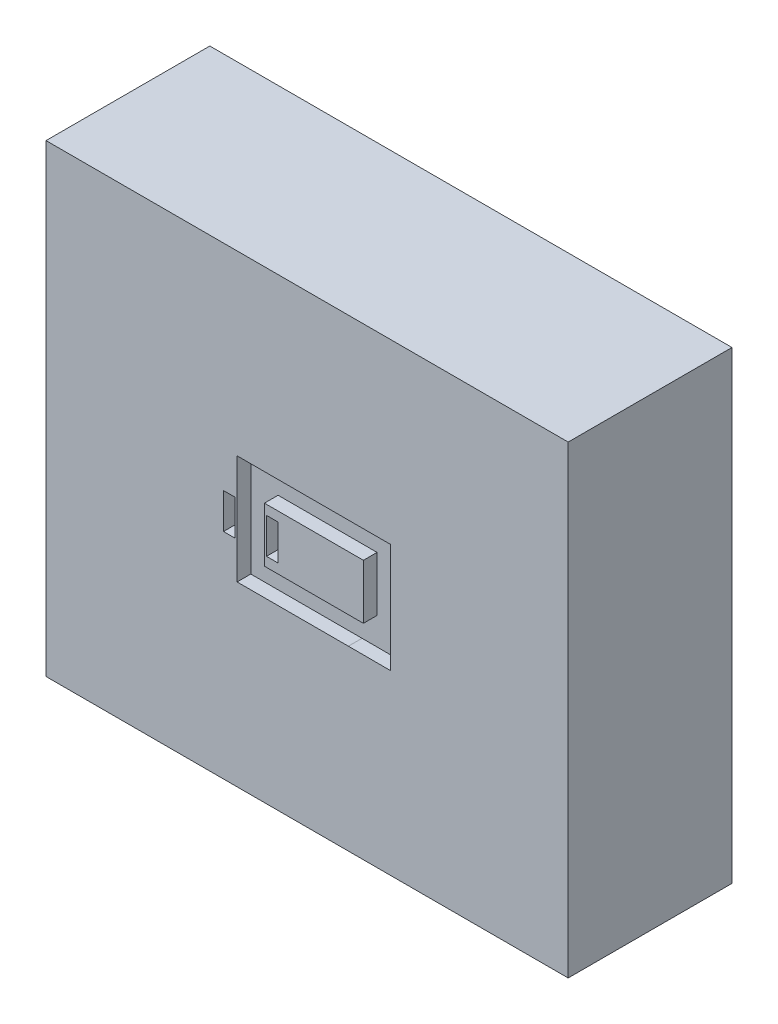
ISO-10303-21;
HEADER;
FILE_DESCRIPTION(('STEP AP214'),'2;1');
FILE_NAME('part.step','',(''),(''),'','','');
FILE_SCHEMA(('AUTOMOTIVE_DESIGN { 1 0 10303 214 1 1 1 1 }'));
ENDSEC;
DATA;
#1=APPLICATION_CONTEXT('core data for automotive mechanical design processes');
#2=APPLICATION_PROTOCOL_DEFINITION('international standard','automotive_design',2000,#1);
#3=PRODUCT_CONTEXT('',#1,'mechanical');
#4=PRODUCT('Part','Part','',(#3));
#5=PRODUCT_RELATED_PRODUCT_CATEGORY('part','',(#4));
#6=PRODUCT_DEFINITION_FORMATION('','',#4);
#7=PRODUCT_DEFINITION_CONTEXT('part definition',#1,'design');
#8=PRODUCT_DEFINITION('design','',#6,#7);
#9=PRODUCT_DEFINITION_SHAPE('','',#8);
#10=(LENGTH_UNIT() NAMED_UNIT(*) SI_UNIT(.MILLI.,.METRE.));
#11=(NAMED_UNIT(*) PLANE_ANGLE_UNIT() SI_UNIT($,.RADIAN.));
#12=(NAMED_UNIT(*) SI_UNIT($,.STERADIAN.) SOLID_ANGLE_UNIT());
#13=UNCERTAINTY_MEASURE_WITH_UNIT(LENGTH_MEASURE(1.E-05),#10,'distance_accuracy_value','');
#14=(GEOMETRIC_REPRESENTATION_CONTEXT(3) GLOBAL_UNCERTAINTY_ASSIGNED_CONTEXT((#13)) GLOBAL_UNIT_ASSIGNED_CONTEXT((#10,
#11,#12)) REPRESENTATION_CONTEXT('',''));
#15=CARTESIAN_POINT('',(0.,0.,0.));
#16=DIRECTION('',(0.,0.,1.));
#17=DIRECTION('',(1.,0.,0.));
#18=AXIS2_PLACEMENT_3D('',#15,#16,#17);
#19=CARTESIAN_POINT('',(-205.478303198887,-182.266063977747,0.));
#20=DIRECTION('',(0.,0.,1.));
#21=DIRECTION('',(1.,0.,0.));
#22=AXIS2_PLACEMENT_3D('',#19,#20,#21);
#23=PLANE('',#22);
#24=DIRECTION('',(0.,-1.,0.));
#25=VECTOR('',#24,1.);
#26=CARTESIAN_POINT('',(-75.4783031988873,0.733936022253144,0.));
#27=LINE('',#26,#25);
#28=CARTESIAN_POINT('',(-75.4783031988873,0.733936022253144,0.));
#29=VERTEX_POINT('',#28);
#30=CARTESIAN_POINT('',(-75.4783031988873,-25.2660639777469,0.));
#31=VERTEX_POINT('',#30);
#32=EDGE_CURVE('E228',#29,#31,#27,.T.);
#33=ORIENTED_EDGE('',*,*,#32,.F.);
#34=DIRECTION('',(-1.,0.,0.));
#35=VECTOR('',#34,1.);
#36=CARTESIAN_POINT('',(-75.4783031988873,0.733936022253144,0.));
#37=LINE('',#36,#35);
#38=CARTESIAN_POINT('',(-66.9783031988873,0.733936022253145,0.));
#39=VERTEX_POINT('',#38);
#40=EDGE_CURVE('E261',#39,#29,#37,.T.);
#41=ORIENTED_EDGE('',*,*,#40,.F.);
#42=DIRECTION('',(0.,-1.,0.));
#43=VECTOR('',#42,1.);
#44=CARTESIAN_POINT('',(-66.9783031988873,0.733936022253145,0.));
#45=LINE('',#44,#43);
#46=CARTESIAN_POINT('',(-66.9783031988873,-25.2660639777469,0.));
#47=VERTEX_POINT('',#46);
#48=EDGE_CURVE('E220',#39,#47,#45,.T.);
#49=ORIENTED_EDGE('',*,*,#48,.T.);
#50=DIRECTION('',(1.,0.,0.));
#51=VECTOR('',#50,1.);
#52=CARTESIAN_POINT('',(-75.4783031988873,-25.2660639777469,0.));
#53=LINE('',#52,#51);
#54=EDGE_CURVE('E62',#31,#47,#53,.T.);
#55=ORIENTED_EDGE('',*,*,#54,.F.);
#56=EDGE_LOOP('',(#33,#41,#49,#55));
#57=FACE_BOUND('',#56,.T.);
#58=DIRECTION('',(0.,1.,0.));
#59=VECTOR('',#58,1.);
#60=CARTESIAN_POINT('',(47.0216968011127,27.7339360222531,0.));
#61=LINE('',#60,#59);
#62=CARTESIAN_POINT('',(47.0216968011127,-52.322844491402,0.));
#63=VERTEX_POINT('',#62);
#64=CARTESIAN_POINT('',(47.0216968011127,27.7339360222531,0.));
#65=VERTEX_POINT('',#64);
#66=EDGE_CURVE('E328',#63,#65,#61,.T.);
#67=ORIENTED_EDGE('',*,*,#66,.F.);
#68=DIRECTION('',(0.999998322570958,-0.00183162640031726,0.));
#69=VECTOR('',#68,1.);
#70=CARTESIAN_POINT('',(47.0216968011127,-52.322844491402,0.));
#71=LINE('',#70,#69);
#72=CARTESIAN_POINT('',(16.0216968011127,-52.2660639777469,0.));
#73=VERTEX_POINT('',#72);
#74=EDGE_CURVE('E324',#73,#63,#71,.T.);
#75=ORIENTED_EDGE('',*,*,#74,.F.);
#76=DIRECTION('',(1.,0.,0.));
#77=VECTOR('',#76,1.);
#78=CARTESIAN_POINT('',(14.5216968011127,-52.2660639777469,0.));
#79=LINE('',#78,#77);
#80=CARTESIAN_POINT('',(-65.4783031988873,-52.2660639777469,0.));
#81=VERTEX_POINT('',#80);
#82=EDGE_CURVE('E356',#81,#73,#79,.T.);
#83=ORIENTED_EDGE('',*,*,#82,.F.);
#84=DIRECTION('',(0.,-1.,0.));
#85=VECTOR('',#84,1.);
#86=CARTESIAN_POINT('',(-65.4783031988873,27.7339360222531,0.));
#87=LINE('',#86,#85);
#88=CARTESIAN_POINT('',(-65.4783031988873,27.7339360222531,0.));
#89=VERTEX_POINT('',#88);
#90=EDGE_CURVE('E285',#89,#81,#87,.T.);
#91=ORIENTED_EDGE('',*,*,#90,.F.);
#92=DIRECTION('',(-1.,0.,0.));
#93=VECTOR('',#92,1.);
#94=CARTESIAN_POINT('',(14.5216968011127,27.7339360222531,0.));
#95=LINE('',#94,#93);
#96=EDGE_CURVE('E348',#65,#89,#95,.T.);
#97=ORIENTED_EDGE('',*,*,#96,.F.);
#98=EDGE_LOOP('',(#67,#75,#83,#91,#97));
#99=FACE_BOUND('',#98,.T.);
#100=DIRECTION('',(0.,-1.,0.));
#101=VECTOR('',#100,1.);
#102=CARTESIAN_POINT('',(-205.478303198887,157.733936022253,0.));
#103=LINE('',#102,#101);
#104=CARTESIAN_POINT('',(-205.478303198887,157.733936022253,0.));
#105=VERTEX_POINT('',#104);
#106=CARTESIAN_POINT('',(-205.478303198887,-182.266063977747,0.));
#107=VERTEX_POINT('',#106);
#108=EDGE_CURVE('E373',#105,#107,#103,.T.);
#109=ORIENTED_EDGE('',*,*,#108,.T.);
#110=DIRECTION('',(1.,0.,0.));
#111=VECTOR('',#110,1.);
#112=CARTESIAN_POINT('',(-205.478303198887,-182.266063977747,0.));
#113=LINE('',#112,#111);
#114=CARTESIAN_POINT('',(177.021696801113,-182.266063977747,0.));
#115=VERTEX_POINT('',#114);
#116=EDGE_CURVE('E394',#107,#115,#113,.T.);
#117=ORIENTED_EDGE('',*,*,#116,.T.);
#118=DIRECTION('',(0.,1.,0.));
#119=VECTOR('',#118,1.);
#120=CARTESIAN_POINT('',(177.021696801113,157.733936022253,0.));
#121=LINE('',#120,#119);
#122=CARTESIAN_POINT('',(177.021696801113,157.733936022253,0.));
#123=VERTEX_POINT('',#122);
#124=EDGE_CURVE('E398',#115,#123,#121,.T.);
#125=ORIENTED_EDGE('',*,*,#124,.T.);
#126=DIRECTION('',(-1.,0.,0.));
#127=VECTOR('',#126,1.);
#128=CARTESIAN_POINT('',(-205.478303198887,157.733936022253,0.));
#129=LINE('',#128,#127);
#130=EDGE_CURVE('E379',#123,#105,#129,.T.);
#131=ORIENTED_EDGE('',*,*,#130,.T.);
#132=EDGE_LOOP('',(#109,#117,#125,#131));
#133=FACE_BOUND('',#132,.T.);
#134=ADVANCED_FACE('F44',(#57,#99,#133),#23,.T.);
#135=CARTESIAN_POINT('',(-205.478303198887,157.733936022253,-120.));
#136=DIRECTION('',(-1.,0.,0.));
#137=DIRECTION('',(0.,-1.,0.));
#138=AXIS2_PLACEMENT_3D('',#135,#136,#137);
#139=PLANE('',#138);
#140=ORIENTED_EDGE('',*,*,#108,.F.);
#141=DIRECTION('',(0.,0.,1.));
#142=VECTOR('',#141,1.);
#143=CARTESIAN_POINT('',(-205.478303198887,157.733936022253,-120.));
#144=LINE('',#143,#142);
#145=CARTESIAN_POINT('',(-205.478303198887,157.733936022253,-120.));
#146=VERTEX_POINT('',#145);
#147=EDGE_CURVE('E11',#146,#105,#144,.T.);
#148=ORIENTED_EDGE('',*,*,#147,.F.);
#149=DIRECTION('',(0.,-1.,0.));
#150=VECTOR('',#149,1.);
#151=CARTESIAN_POINT('',(-205.478303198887,157.733936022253,-120.));
#152=LINE('',#151,#150);
#153=CARTESIAN_POINT('',(-205.478303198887,-182.266063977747,-120.));
#154=VERTEX_POINT('',#153);
#155=EDGE_CURVE('E374',#146,#154,#152,.T.);
#156=ORIENTED_EDGE('',*,*,#155,.T.);
#157=DIRECTION('',(0.,0.,1.));
#158=VECTOR('',#157,1.);
#159=CARTESIAN_POINT('',(-205.478303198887,-182.266063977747,-120.));
#160=LINE('',#159,#158);
#161=EDGE_CURVE('E48',#154,#107,#160,.T.);
#162=ORIENTED_EDGE('',*,*,#161,.T.);
#163=EDGE_LOOP('',(#140,#148,#156,#162));
#164=FACE_BOUND('',#163,.T.);
#165=ADVANCED_FACE('F46',(#164),#139,.T.);
#166=CARTESIAN_POINT('',(-205.478303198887,157.733936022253,-120.));
#167=DIRECTION('',(0.,1.,0.));
#168=DIRECTION('',(0.,0.,1.));
#169=AXIS2_PLACEMENT_3D('',#166,#167,#168);
#170=PLANE('',#169);
#171=ORIENTED_EDGE('',*,*,#130,.F.);
#172=DIRECTION('',(0.,0.,1.));
#173=VECTOR('',#172,1.);
#174=CARTESIAN_POINT('',(177.021696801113,157.733936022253,-120.));
#175=LINE('',#174,#173);
#176=CARTESIAN_POINT('',(177.021696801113,157.733936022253,-120.));
#177=VERTEX_POINT('',#176);
#178=EDGE_CURVE('E54',#177,#123,#175,.T.);
#179=ORIENTED_EDGE('',*,*,#178,.F.);
#180=DIRECTION('',(-1.,0.,0.));
#181=VECTOR('',#180,1.);
#182=CARTESIAN_POINT('',(-205.478303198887,157.733936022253,-120.));
#183=LINE('',#182,#181);
#184=EDGE_CURVE('E387',#177,#146,#183,.T.);
#185=ORIENTED_EDGE('',*,*,#184,.T.);
#186=ORIENTED_EDGE('',*,*,#147,.T.);
#187=EDGE_LOOP('',(#171,#179,#185,#186));
#188=FACE_BOUND('',#187,.T.);
#189=ADVANCED_FACE('F420',(#188),#170,.T.);
#190=CARTESIAN_POINT('',(177.021696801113,157.733936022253,-120.));
#191=DIRECTION('',(1.,0.,0.));
#192=DIRECTION('',(0.,1.,0.));
#193=AXIS2_PLACEMENT_3D('',#190,#191,#192);
#194=PLANE('',#193);
#195=ORIENTED_EDGE('',*,*,#124,.F.);
#196=DIRECTION('',(0.,0.,1.));
#197=VECTOR('',#196,1.);
#198=CARTESIAN_POINT('',(177.021696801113,-182.266063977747,-120.));
#199=LINE('',#198,#197);
#200=CARTESIAN_POINT('',(177.021696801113,-182.266063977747,-120.));
#201=VERTEX_POINT('',#200);
#202=EDGE_CURVE('E406',#201,#115,#199,.T.);
#203=ORIENTED_EDGE('',*,*,#202,.F.);
#204=DIRECTION('',(0.,1.,0.));
#205=VECTOR('',#204,1.);
#206=CARTESIAN_POINT('',(177.021696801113,157.733936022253,-120.));
#207=LINE('',#206,#205);
#208=EDGE_CURVE('E383',#201,#177,#207,.T.);
#209=ORIENTED_EDGE('',*,*,#208,.T.);
#210=ORIENTED_EDGE('',*,*,#178,.T.);
#211=EDGE_LOOP('',(#195,#203,#209,#210));
#212=FACE_BOUND('',#211,.T.);
#213=ADVANCED_FACE('F426',(#212),#194,.T.);
#214=CARTESIAN_POINT('',(-205.478303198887,-182.266063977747,-120.));
#215=DIRECTION('',(0.,-1.,0.));
#216=DIRECTION('',(0.,0.,-1.));
#217=AXIS2_PLACEMENT_3D('',#214,#215,#216);
#218=PLANE('',#217);
#219=ORIENTED_EDGE('',*,*,#116,.F.);
#220=ORIENTED_EDGE('',*,*,#161,.F.);
#221=DIRECTION('',(1.,0.,0.));
#222=VECTOR('',#221,1.);
#223=CARTESIAN_POINT('',(-205.478303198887,-182.266063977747,-120.));
#224=LINE('',#223,#222);
#225=EDGE_CURVE('E378',#154,#201,#224,.T.);
#226=ORIENTED_EDGE('',*,*,#225,.T.);
#227=ORIENTED_EDGE('',*,*,#202,.T.);
#228=EDGE_LOOP('',(#219,#220,#226,#227));
#229=FACE_BOUND('',#228,.T.);
#230=ADVANCED_FACE('F416',(#229),#218,.T.);
#231=CARTESIAN_POINT('',(-205.478303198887,-182.266063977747,-120.));
#232=DIRECTION('',(0.,0.,1.));
#233=DIRECTION('',(1.,0.,0.));
#234=AXIS2_PLACEMENT_3D('',#231,#232,#233);
#235=PLANE('',#234);
#236=ORIENTED_EDGE('',*,*,#155,.F.);
#237=ORIENTED_EDGE('',*,*,#184,.F.);
#238=ORIENTED_EDGE('',*,*,#208,.F.);
#239=ORIENTED_EDGE('',*,*,#225,.F.);
#240=EDGE_LOOP('',(#236,#237,#238,#239));
#241=FACE_BOUND('',#240,.T.);
#242=ADVANCED_FACE('F423',(#241),#235,.F.);
#243=CARTESIAN_POINT('',(14.5216968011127,-32.2660639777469,-30.0561711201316));
#244=DIRECTION('',(0.,1.,0.));
#245=DIRECTION('',(0.,0.,1.));
#246=AXIS2_PLACEMENT_3D('',#243,#244,#245);
#247=PLANE('',#246);
#248=DIRECTION('',(1.,0.,0.));
#249=VECTOR('',#248,1.);
#250=CARTESIAN_POINT('',(14.5216968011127,-32.2660639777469,-10.));
#251=LINE('',#250,#249);
#252=CARTESIAN_POINT('',(-45.4783031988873,-32.2660639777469,-10.));
#253=VERTEX_POINT('',#252);
#254=CARTESIAN_POINT('',(27.0216968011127,-32.2660639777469,-9.99999999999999));
#255=VERTEX_POINT('',#254);
#256=EDGE_CURVE('E357',#253,#255,#251,.T.);
#257=ORIENTED_EDGE('',*,*,#256,.T.);
#258=DIRECTION('',(0.,0.,1.));
#259=VECTOR('',#258,1.);
#260=CARTESIAN_POINT('',(27.0216968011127,-32.2660639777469,-95.8492172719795));
#261=LINE('',#260,#259);
#262=CARTESIAN_POINT('',(27.0216968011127,-32.2660639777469,0.));
#263=VERTEX_POINT('',#262);
#264=EDGE_CURVE('E338',#255,#263,#261,.T.);
#265=ORIENTED_EDGE('',*,*,#264,.T.);
#266=DIRECTION('',(-1.,0.,0.));
#267=VECTOR('',#266,1.);
#268=CARTESIAN_POINT('',(14.5216968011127,-32.2660639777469,0.));
#269=LINE('',#268,#267);
#270=CARTESIAN_POINT('',(-45.4783031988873,-32.2660639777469,0.));
#271=VERTEX_POINT('',#270);
#272=EDGE_CURVE('E365',#263,#271,#269,.T.);
#273=ORIENTED_EDGE('',*,*,#272,.T.);
#274=DIRECTION('',(0.,0.,-1.));
#275=VECTOR('',#274,1.);
#276=CARTESIAN_POINT('',(-45.4783031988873,-32.2660639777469,0.));
#277=LINE('',#276,#275);
#278=EDGE_CURVE('E295',#271,#253,#277,.T.);
#279=ORIENTED_EDGE('',*,*,#278,.T.);
#280=EDGE_LOOP('',(#257,#265,#273,#279));
#281=FACE_BOUND('',#280,.T.);
#282=ADVANCED_FACE('F473',(#281),#247,.F.);
#283=CARTESIAN_POINT('',(14.5216968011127,-52.2660639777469,-30.0561711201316));
#284=DIRECTION('',(0.,-1.,0.));
#285=DIRECTION('',(0.,0.,-1.));
#286=AXIS2_PLACEMENT_3D('',#283,#284,#285);
#287=PLANE('',#286);
#288=DIRECTION('',(-1.,0.,0.));
#289=VECTOR('',#288,1.);
#290=CARTESIAN_POINT('',(14.5216968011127,-52.2660639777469,-10.));
#291=LINE('',#290,#289);
#292=CARTESIAN_POINT('',(16.0216968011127,-52.2660639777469,-10.));
#293=VERTEX_POINT('',#292);
#294=CARTESIAN_POINT('',(-65.4783031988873,-52.2660639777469,-10.));
#295=VERTEX_POINT('',#294);
#296=EDGE_CURVE('E360',#293,#295,#291,.T.);
#297=ORIENTED_EDGE('',*,*,#296,.T.);
#298=DIRECTION('',(0.,0.,-1.));
#299=VECTOR('',#298,1.);
#300=CARTESIAN_POINT('',(-65.4783031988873,-52.2660639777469,0.));
#301=LINE('',#300,#299);
#302=EDGE_CURVE('E299',#81,#295,#301,.T.);
#303=ORIENTED_EDGE('',*,*,#302,.F.);
#304=ORIENTED_EDGE('',*,*,#82,.T.);
#305=DIRECTION('',(0.,0.,1.));
#306=VECTOR('',#305,1.);
#307=CARTESIAN_POINT('',(16.0216968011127,-52.2660639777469,-30.0561711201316));
#308=LINE('',#307,#306);
#309=EDGE_CURVE('E361',#293,#73,#308,.T.);
#310=ORIENTED_EDGE('',*,*,#309,.F.);
#311=EDGE_LOOP('',(#297,#303,#304,#310));
#312=FACE_BOUND('',#311,.T.);
#313=ADVANCED_FACE('F478',(#312),#287,.F.);
#314=CARTESIAN_POINT('',(14.5216968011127,7.73393602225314,-10.));
#315=DIRECTION('',(0.,0.,1.));
#316=DIRECTION('',(1.,0.,0.));
#317=AXIS2_PLACEMENT_3D('',#314,#315,#316);
#318=PLANE('',#317);
#319=DIRECTION('',(-0.999998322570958,0.00183162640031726,0.));
#320=VECTOR('',#319,1.);
#321=CARTESIAN_POINT('',(47.0216968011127,-52.322844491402,-9.99999999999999));
#322=LINE('',#321,#320);
#323=CARTESIAN_POINT('',(47.0216968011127,-52.322844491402,-9.99999999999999));
#324=VERTEX_POINT('',#323);
#325=EDGE_CURVE('E312',#324,#293,#322,.T.);
#326=ORIENTED_EDGE('',*,*,#325,.F.);
#327=DIRECTION('',(0.,-1.,0.));
#328=VECTOR('',#327,1.);
#329=CARTESIAN_POINT('',(47.0216968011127,27.7339360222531,-9.99999999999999));
#330=LINE('',#329,#328);
#331=CARTESIAN_POINT('',(47.0216968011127,27.7339360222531,-9.99999999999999));
#332=VERTEX_POINT('',#331);
#333=EDGE_CURVE('E317',#332,#324,#330,.T.);
#334=ORIENTED_EDGE('',*,*,#333,.F.);
#335=DIRECTION('',(1.,0.,0.));
#336=VECTOR('',#335,1.);
#337=CARTESIAN_POINT('',(14.5216968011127,27.7339360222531,-10.));
#338=LINE('',#337,#336);
#339=CARTESIAN_POINT('',(-65.4783031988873,27.7339360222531,-10.));
#340=VERTEX_POINT('',#339);
#341=EDGE_CURVE('E344',#340,#332,#338,.T.);
#342=ORIENTED_EDGE('',*,*,#341,.F.);
#343=DIRECTION('',(0.,-1.,0.));
#344=VECTOR('',#343,1.);
#345=CARTESIAN_POINT('',(-65.4783031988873,27.7339360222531,-10.));
#346=LINE('',#345,#344);
#347=EDGE_CURVE('E268',#340,#295,#346,.T.);
#348=ORIENTED_EDGE('',*,*,#347,.T.);
#349=ORIENTED_EDGE('',*,*,#296,.F.);
#350=EDGE_LOOP('',(#326,#334,#342,#348,#349));
#351=FACE_BOUND('',#350,.T.);
#352=ORIENTED_EDGE('',*,*,#256,.F.);
#353=DIRECTION('',(0.,1.,0.));
#354=VECTOR('',#353,1.);
#355=CARTESIAN_POINT('',(-45.4783031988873,-32.2660639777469,-10.));
#356=LINE('',#355,#354);
#357=CARTESIAN_POINT('',(-45.4783031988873,7.73393602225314,-10.));
#358=VERTEX_POINT('',#357);
#359=EDGE_CURVE('E281',#253,#358,#356,.T.);
#360=ORIENTED_EDGE('',*,*,#359,.T.);
#361=DIRECTION('',(-1.,0.,0.));
#362=VECTOR('',#361,1.);
#363=CARTESIAN_POINT('',(14.5216968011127,7.73393602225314,-10.));
#364=LINE('',#363,#362);
#365=CARTESIAN_POINT('',(27.0216968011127,7.73393602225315,-9.99999999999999));
#366=VERTEX_POINT('',#365);
#367=EDGE_CURVE('E347',#366,#358,#364,.T.);
#368=ORIENTED_EDGE('',*,*,#367,.F.);
#369=DIRECTION('',(0.,1.,0.));
#370=VECTOR('',#369,1.);
#371=CARTESIAN_POINT('',(27.0216968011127,-32.2660639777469,-9.99999999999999));
#372=LINE('',#371,#370);
#373=EDGE_CURVE('E308',#255,#366,#372,.T.);
#374=ORIENTED_EDGE('',*,*,#373,.F.);
#375=EDGE_LOOP('',(#352,#360,#368,#374));
#376=FACE_BOUND('',#375,.T.);
#377=ADVANCED_FACE('F475',(#351,#376),#318,.T.);
#378=CARTESIAN_POINT('',(14.5216968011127,27.7339360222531,-30.1556443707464));
#379=DIRECTION('',(0.,1.,0.));
#380=DIRECTION('',(0.,0.,1.));
#381=AXIS2_PLACEMENT_3D('',#378,#379,#380);
#382=PLANE('',#381);
#383=ORIENTED_EDGE('',*,*,#341,.T.);
#384=DIRECTION('',(0.,0.,1.));
#385=VECTOR('',#384,1.);
#386=CARTESIAN_POINT('',(47.0216968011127,27.7339360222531,-95.8492172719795));
#387=LINE('',#386,#385);
#388=EDGE_CURVE('E313',#332,#65,#387,.T.);
#389=ORIENTED_EDGE('',*,*,#388,.T.);
#390=ORIENTED_EDGE('',*,*,#96,.T.);
#391=DIRECTION('',(0.,0.,-1.));
#392=VECTOR('',#391,1.);
#393=CARTESIAN_POINT('',(-65.4783031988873,27.7339360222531,0.));
#394=LINE('',#393,#392);
#395=EDGE_CURVE('E303',#89,#340,#394,.T.);
#396=ORIENTED_EDGE('',*,*,#395,.T.);
#397=EDGE_LOOP('',(#383,#389,#390,#396));
#398=FACE_BOUND('',#397,.T.);
#399=ADVANCED_FACE('F477',(#398),#382,.F.);
#400=CARTESIAN_POINT('',(14.5216968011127,7.73393602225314,-30.1556443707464));
#401=DIRECTION('',(0.,-1.,0.));
#402=DIRECTION('',(0.,0.,-1.));
#403=AXIS2_PLACEMENT_3D('',#400,#401,#402);
#404=PLANE('',#403);
#405=ORIENTED_EDGE('',*,*,#367,.T.);
#406=DIRECTION('',(0.,0.,-1.));
#407=VECTOR('',#406,1.);
#408=CARTESIAN_POINT('',(-45.4783031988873,7.73393602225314,0.));
#409=LINE('',#408,#407);
#410=CARTESIAN_POINT('',(-45.4783031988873,7.73393602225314,0.));
#411=VERTEX_POINT('',#410);
#412=EDGE_CURVE('E291',#411,#358,#409,.T.);
#413=ORIENTED_EDGE('',*,*,#412,.F.);
#414=DIRECTION('',(1.,0.,0.));
#415=VECTOR('',#414,1.);
#416=CARTESIAN_POINT('',(14.5216968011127,7.73393602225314,0.));
#417=LINE('',#416,#415);
#418=CARTESIAN_POINT('',(27.0216968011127,7.73393602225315,0.));
#419=VERTEX_POINT('',#418);
#420=EDGE_CURVE('E320',#411,#419,#417,.T.);
#421=ORIENTED_EDGE('',*,*,#420,.T.);
#422=DIRECTION('',(0.,0.,1.));
#423=VECTOR('',#422,1.);
#424=CARTESIAN_POINT('',(27.0216968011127,7.73393602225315,-95.8492172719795));
#425=LINE('',#424,#423);
#426=EDGE_CURVE('E332',#366,#419,#425,.T.);
#427=ORIENTED_EDGE('',*,*,#426,.F.);
#428=EDGE_LOOP('',(#405,#413,#421,#427));
#429=FACE_BOUND('',#428,.T.);
#430=ADVANCED_FACE('F469',(#429),#404,.F.);
#431=CARTESIAN_POINT('',(47.0216968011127,27.7339360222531,-95.8492172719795));
#432=DIRECTION('',(1.,0.,0.));
#433=DIRECTION('',(0.,1.,0.));
#434=AXIS2_PLACEMENT_3D('',#431,#432,#433);
#435=PLANE('',#434);
#436=ORIENTED_EDGE('',*,*,#333,.T.);
#437=DIRECTION('',(0.,0.,1.));
#438=VECTOR('',#437,1.);
#439=CARTESIAN_POINT('',(47.0216968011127,-52.322844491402,-95.8492172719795));
#440=LINE('',#439,#438);
#441=EDGE_CURVE('E335',#324,#63,#440,.T.);
#442=ORIENTED_EDGE('',*,*,#441,.T.);
#443=ORIENTED_EDGE('',*,*,#66,.T.);
#444=ORIENTED_EDGE('',*,*,#388,.F.);
#445=EDGE_LOOP('',(#436,#442,#443,#444));
#446=FACE_BOUND('',#445,.T.);
#447=ADVANCED_FACE('F516',(#446),#435,.F.);
#448=CARTESIAN_POINT('',(47.0216968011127,-52.322844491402,-95.8492172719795));
#449=DIRECTION('',(-0.00183162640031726,-0.999998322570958,0.));
#450=DIRECTION('',(0.999998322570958,-0.00183162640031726,0.));
#451=AXIS2_PLACEMENT_3D('',#448,#449,#450);
#452=PLANE('',#451);
#453=ORIENTED_EDGE('',*,*,#325,.T.);
#454=ORIENTED_EDGE('',*,*,#309,.T.);
#455=ORIENTED_EDGE('',*,*,#74,.T.);
#456=ORIENTED_EDGE('',*,*,#441,.F.);
#457=EDGE_LOOP('',(#453,#454,#455,#456));
#458=FACE_BOUND('',#457,.T.);
#459=ADVANCED_FACE('F522',(#458),#452,.F.);
#460=CARTESIAN_POINT('',(27.0216968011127,-32.2660639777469,-95.8492172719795));
#461=DIRECTION('',(-1.,0.,0.));
#462=DIRECTION('',(0.,0.,1.));
#463=AXIS2_PLACEMENT_3D('',#460,#461,#462);
#464=PLANE('',#463);
#465=ORIENTED_EDGE('',*,*,#373,.T.);
#466=ORIENTED_EDGE('',*,*,#426,.T.);
#467=DIRECTION('',(0.,-1.,0.));
#468=VECTOR('',#467,1.);
#469=CARTESIAN_POINT('',(27.0216968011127,-32.2660639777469,0.));
#470=LINE('',#469,#468);
#471=EDGE_CURVE('E307',#419,#263,#470,.T.);
#472=ORIENTED_EDGE('',*,*,#471,.T.);
#473=ORIENTED_EDGE('',*,*,#264,.F.);
#474=EDGE_LOOP('',(#465,#466,#472,#473));
#475=FACE_BOUND('',#474,.T.);
#476=ADVANCED_FACE('F465',(#475),#464,.F.);
#477=CARTESIAN_POINT('',(-65.4783031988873,27.7339360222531,0.));
#478=DIRECTION('',(1.,0.,0.));
#479=DIRECTION('',(0.,0.,-1.));
#480=AXIS2_PLACEMENT_3D('',#477,#478,#479);
#481=PLANE('',#480);
#482=ORIENTED_EDGE('',*,*,#347,.F.);
#483=ORIENTED_EDGE('',*,*,#395,.F.);
#484=ORIENTED_EDGE('',*,*,#90,.T.);
#485=ORIENTED_EDGE('',*,*,#302,.T.);
#486=EDGE_LOOP('',(#482,#483,#484,#485));
#487=FACE_BOUND('',#486,.T.);
#488=ADVANCED_FACE('F453',(#487),#481,.T.);
#489=CARTESIAN_POINT('',(-45.4783031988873,-32.2660639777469,0.));
#490=DIRECTION('',(-1.,0.,0.));
#491=DIRECTION('',(0.,0.,1.));
#492=AXIS2_PLACEMENT_3D('',#489,#490,#491);
#493=PLANE('',#492);
#494=ORIENTED_EDGE('',*,*,#359,.F.);
#495=ORIENTED_EDGE('',*,*,#278,.F.);
#496=DIRECTION('',(0.,1.,0.));
#497=VECTOR('',#496,1.);
#498=CARTESIAN_POINT('',(-45.4783031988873,-32.2660639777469,0.));
#499=LINE('',#498,#497);
#500=EDGE_CURVE('E288',#271,#411,#499,.T.);
#501=ORIENTED_EDGE('',*,*,#500,.T.);
#502=ORIENTED_EDGE('',*,*,#412,.T.);
#503=EDGE_LOOP('',(#494,#495,#501,#502));
#504=FACE_BOUND('',#503,.T.);
#505=ADVANCED_FACE('F446',(#504),#493,.T.);
#506=DIRECTION('',(0.,1.,0.));
#507=VECTOR('',#506,1.);
#508=CARTESIAN_POINT('',(-35.4783031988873,0.733936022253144,0.));
#509=LINE('',#508,#507);
#510=CARTESIAN_POINT('',(-35.4783031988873,-25.2660639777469,0.));
#511=VERTEX_POINT('',#510);
#512=CARTESIAN_POINT('',(-35.4783031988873,0.733936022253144,0.));
#513=VERTEX_POINT('',#512);
#514=EDGE_CURVE('E257',#511,#513,#509,.T.);
#515=ORIENTED_EDGE('',*,*,#514,.F.);
#516=CARTESIAN_POINT('',(-43.9783031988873,-25.2660639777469,0.));
#517=VERTEX_POINT('',#516);
#518=EDGE_CURVE('E254',#517,#511,#53,.T.);
#519=ORIENTED_EDGE('',*,*,#518,.F.);
#520=DIRECTION('',(0.,1.,0.));
#521=VECTOR('',#520,1.);
#522=CARTESIAN_POINT('',(-43.9783031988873,0.733936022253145,0.));
#523=LINE('',#522,#521);
#524=CARTESIAN_POINT('',(-43.9783031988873,0.733936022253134,0.));
#525=VERTEX_POINT('',#524);
#526=EDGE_CURVE('E208',#517,#525,#523,.T.);
#527=ORIENTED_EDGE('',*,*,#526,.T.);
#528=EDGE_CURVE('E70',#513,#525,#37,.T.);
#529=ORIENTED_EDGE('',*,*,#528,.F.);
#530=EDGE_LOOP('',(#515,#519,#527,#529));
#531=FACE_BOUND('',#530,.T.);
#532=ORIENTED_EDGE('',*,*,#471,.F.);
#533=ORIENTED_EDGE('',*,*,#420,.F.);
#534=ORIENTED_EDGE('',*,*,#500,.F.);
#535=ORIENTED_EDGE('',*,*,#272,.F.);
#536=EDGE_LOOP('',(#532,#533,#534,#535));
#537=FACE_BOUND('',#536,.T.);
#538=ADVANCED_FACE('F437',(#531,#537),#23,.T.);
#539=CARTESIAN_POINT('',(-75.4783031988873,0.733936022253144,-20.));
#540=DIRECTION('',(0.,1.,0.));
#541=DIRECTION('',(0.,0.,1.));
#542=AXIS2_PLACEMENT_3D('',#539,#540,#541);
#543=PLANE('',#542);
#544=DIRECTION('',(0.,0.,1.));
#545=VECTOR('',#544,1.);
#546=CARTESIAN_POINT('',(-66.9783031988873,0.733936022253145,-11.5));
#547=LINE('',#546,#545);
#548=CARTESIAN_POINT('',(-66.9783031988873,0.733936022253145,-11.5));
#549=VERTEX_POINT('',#548);
#550=EDGE_CURVE('E203',#549,#39,#547,.T.);
#551=ORIENTED_EDGE('',*,*,#550,.T.);
#552=ORIENTED_EDGE('',*,*,#40,.T.);
#553=DIRECTION('',(0.,0.,1.));
#554=VECTOR('',#553,1.);
#555=CARTESIAN_POINT('',(-75.4783031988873,0.733936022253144,-20.));
#556=LINE('',#555,#554);
#557=CARTESIAN_POINT('',(-75.4783031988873,0.733936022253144,-20.));
#558=VERTEX_POINT('',#557);
#559=EDGE_CURVE('E264',#558,#29,#556,.T.);
#560=ORIENTED_EDGE('',*,*,#559,.F.);
#561=DIRECTION('',(-1.,0.,0.));
#562=VECTOR('',#561,1.);
#563=CARTESIAN_POINT('',(-75.4783031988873,0.733936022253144,-20.));
#564=LINE('',#563,#562);
#565=CARTESIAN_POINT('',(-35.4783031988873,0.733936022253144,-20.));
#566=VERTEX_POINT('',#565);
#567=EDGE_CURVE('E246',#566,#558,#564,.T.);
#568=ORIENTED_EDGE('',*,*,#567,.F.);
#569=DIRECTION('',(0.,0.,1.));
#570=VECTOR('',#569,1.);
#571=CARTESIAN_POINT('',(-35.4783031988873,0.733936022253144,-20.));
#572=LINE('',#571,#570);
#573=EDGE_CURVE('E269',#566,#513,#572,.T.);
#574=ORIENTED_EDGE('',*,*,#573,.T.);
#575=ORIENTED_EDGE('',*,*,#528,.T.);
#576=DIRECTION('',(0.,0.,1.));
#577=VECTOR('',#576,1.);
#578=CARTESIAN_POINT('',(-43.9783031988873,0.733936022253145,-11.5));
#579=LINE('',#578,#577);
#580=CARTESIAN_POINT('',(-43.9783031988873,0.733936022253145,-11.5));
#581=VERTEX_POINT('',#580);
#582=EDGE_CURVE('E229',#581,#525,#579,.T.);
#583=ORIENTED_EDGE('',*,*,#582,.F.);
#584=DIRECTION('',(-1.,0.,0.));
#585=VECTOR('',#584,1.);
#586=CARTESIAN_POINT('',(-66.9783031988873,0.733936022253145,-11.5));
#587=LINE('',#586,#585);
#588=EDGE_CURVE('E198',#581,#549,#587,.T.);
#589=ORIENTED_EDGE('',*,*,#588,.T.);
#590=EDGE_LOOP('',(#551,#552,#560,#568,#574,#575,#583,#589));
#591=FACE_BOUND('',#590,.T.);
#592=ADVANCED_FACE('F445',(#591),#543,.F.);
#593=CARTESIAN_POINT('',(-75.4783031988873,-25.2660639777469,-20.));
#594=DIRECTION('',(0.,-1.,0.));
#595=DIRECTION('',(0.,0.,-1.));
#596=AXIS2_PLACEMENT_3D('',#593,#594,#595);
#597=PLANE('',#596);
#598=DIRECTION('',(0.,0.,1.));
#599=VECTOR('',#598,1.);
#600=CARTESIAN_POINT('',(-66.9783031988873,-25.2660639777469,-11.5));
#601=LINE('',#600,#599);
#602=CARTESIAN_POINT('',(-66.9783031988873,-25.2660639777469,-11.5));
#603=VERTEX_POINT('',#602);
#604=EDGE_CURVE('E187',#603,#47,#601,.T.);
#605=ORIENTED_EDGE('',*,*,#604,.F.);
#606=DIRECTION('',(1.,0.,0.));
#607=VECTOR('',#606,1.);
#608=CARTESIAN_POINT('',(-66.9783031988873,-25.2660639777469,-11.5));
#609=LINE('',#608,#607);
#610=CARTESIAN_POINT('',(-43.9783031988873,-25.2660639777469,-11.5));
#611=VERTEX_POINT('',#610);
#612=EDGE_CURVE('E191',#603,#611,#609,.T.);
#613=ORIENTED_EDGE('',*,*,#612,.T.);
#614=DIRECTION('',(0.,0.,1.));
#615=VECTOR('',#614,1.);
#616=CARTESIAN_POINT('',(-43.9783031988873,-25.2660639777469,-11.5));
#617=LINE('',#616,#615);
#618=EDGE_CURVE('E197',#611,#517,#617,.T.);
#619=ORIENTED_EDGE('',*,*,#618,.T.);
#620=ORIENTED_EDGE('',*,*,#518,.T.);
#621=DIRECTION('',(0.,0.,1.));
#622=VECTOR('',#621,1.);
#623=CARTESIAN_POINT('',(-35.4783031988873,-25.2660639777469,-20.));
#624=LINE('',#623,#622);
#625=CARTESIAN_POINT('',(-35.4783031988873,-25.2660639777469,-20.));
#626=VERTEX_POINT('',#625);
#627=EDGE_CURVE('E272',#626,#511,#624,.T.);
#628=ORIENTED_EDGE('',*,*,#627,.F.);
#629=DIRECTION('',(1.,0.,0.));
#630=VECTOR('',#629,1.);
#631=CARTESIAN_POINT('',(-75.4783031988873,-25.2660639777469,-20.));
#632=LINE('',#631,#630);
#633=CARTESIAN_POINT('',(-75.4783031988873,-25.2660639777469,-20.));
#634=VERTEX_POINT('',#633);
#635=EDGE_CURVE('E238',#634,#626,#632,.T.);
#636=ORIENTED_EDGE('',*,*,#635,.F.);
#637=DIRECTION('',(0.,0.,1.));
#638=VECTOR('',#637,1.);
#639=CARTESIAN_POINT('',(-75.4783031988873,-25.2660639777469,-20.));
#640=LINE('',#639,#638);
#641=EDGE_CURVE('E250',#634,#31,#640,.T.);
#642=ORIENTED_EDGE('',*,*,#641,.T.);
#643=ORIENTED_EDGE('',*,*,#54,.T.);
#644=EDGE_LOOP('',(#605,#613,#619,#620,#628,#636,#642,#643));
#645=FACE_BOUND('',#644,.T.);
#646=ADVANCED_FACE('F189',(#645),#597,.F.);
#647=CARTESIAN_POINT('',(-75.4783031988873,0.733936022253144,-20.));
#648=DIRECTION('',(-1.,0.,0.));
#649=DIRECTION('',(0.,0.,1.));
#650=AXIS2_PLACEMENT_3D('',#647,#648,#649);
#651=PLANE('',#650);
#652=ORIENTED_EDGE('',*,*,#32,.T.);
#653=ORIENTED_EDGE('',*,*,#641,.F.);
#654=DIRECTION('',(0.,-1.,0.));
#655=VECTOR('',#654,1.);
#656=CARTESIAN_POINT('',(-75.4783031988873,0.733936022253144,-20.));
#657=LINE('',#656,#655);
#658=EDGE_CURVE('E234',#558,#634,#657,.T.);
#659=ORIENTED_EDGE('',*,*,#658,.F.);
#660=ORIENTED_EDGE('',*,*,#559,.T.);
#661=EDGE_LOOP('',(#652,#653,#659,#660));
#662=FACE_BOUND('',#661,.T.);
#663=ADVANCED_FACE('F560',(#662),#651,.F.);
#664=CARTESIAN_POINT('',(-35.4783031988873,0.733936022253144,-20.));
#665=DIRECTION('',(1.,0.,0.));
#666=DIRECTION('',(0.,0.,-1.));
#667=AXIS2_PLACEMENT_3D('',#664,#665,#666);
#668=PLANE('',#667);
#669=ORIENTED_EDGE('',*,*,#514,.T.);
#670=ORIENTED_EDGE('',*,*,#573,.F.);
#671=DIRECTION('',(0.,1.,0.));
#672=VECTOR('',#671,1.);
#673=CARTESIAN_POINT('',(-35.4783031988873,0.733936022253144,-20.));
#674=LINE('',#673,#672);
#675=EDGE_CURVE('E242',#626,#566,#674,.T.);
#676=ORIENTED_EDGE('',*,*,#675,.F.);
#677=ORIENTED_EDGE('',*,*,#627,.T.);
#678=EDGE_LOOP('',(#669,#670,#676,#677));
#679=FACE_BOUND('',#678,.T.);
#680=ADVANCED_FACE('F567',(#679),#668,.F.);
#681=CARTESIAN_POINT('',(-75.4783031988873,-25.2660639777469,-20.));
#682=DIRECTION('',(0.,0.,1.));
#683=DIRECTION('',(1.,0.,0.));
#684=AXIS2_PLACEMENT_3D('',#681,#682,#683);
#685=PLANE('',#684);
#686=ORIENTED_EDGE('',*,*,#658,.T.);
#687=ORIENTED_EDGE('',*,*,#635,.T.);
#688=ORIENTED_EDGE('',*,*,#675,.T.);
#689=ORIENTED_EDGE('',*,*,#567,.T.);
#690=EDGE_LOOP('',(#686,#687,#688,#689));
#691=FACE_BOUND('',#690,.T.);
#692=ADVANCED_FACE('F575',(#691),#685,.T.);
#693=CARTESIAN_POINT('',(-66.9783031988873,0.733936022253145,-11.5));
#694=DIRECTION('',(-1.,0.,0.));
#695=DIRECTION('',(0.,0.,1.));
#696=AXIS2_PLACEMENT_3D('',#693,#694,#695);
#697=PLANE('',#696);
#698=ORIENTED_EDGE('',*,*,#48,.F.);
#699=ORIENTED_EDGE('',*,*,#550,.F.);
#700=DIRECTION('',(0.,-1.,0.));
#701=VECTOR('',#700,1.);
#702=CARTESIAN_POINT('',(-66.9783031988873,0.733936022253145,-11.5));
#703=LINE('',#702,#701);
#704=EDGE_CURVE('E201',#549,#603,#703,.T.);
#705=ORIENTED_EDGE('',*,*,#704,.T.);
#706=ORIENTED_EDGE('',*,*,#604,.T.);
#707=EDGE_LOOP('',(#698,#699,#705,#706));
#708=FACE_BOUND('',#707,.T.);
#709=ADVANCED_FACE('F202',(#708),#697,.T.);
#710=CARTESIAN_POINT('',(-43.9783031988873,0.733936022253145,-11.5));
#711=DIRECTION('',(1.,0.,0.));
#712=DIRECTION('',(0.,0.,-1.));
#713=AXIS2_PLACEMENT_3D('',#710,#711,#712);
#714=PLANE('',#713);
#715=ORIENTED_EDGE('',*,*,#526,.F.);
#716=ORIENTED_EDGE('',*,*,#618,.F.);
#717=DIRECTION('',(0.,1.,0.));
#718=VECTOR('',#717,1.);
#719=CARTESIAN_POINT('',(-43.9783031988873,0.733936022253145,-11.5));
#720=LINE('',#719,#718);
#721=EDGE_CURVE('E212',#611,#581,#720,.T.);
#722=ORIENTED_EDGE('',*,*,#721,.T.);
#723=ORIENTED_EDGE('',*,*,#582,.T.);
#724=EDGE_LOOP('',(#715,#716,#722,#723));
#725=FACE_BOUND('',#724,.T.);
#726=ADVANCED_FACE('F590',(#725),#714,.T.);
#727=CARTESIAN_POINT('',(-66.9783031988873,-25.2660639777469,-11.5));
#728=DIRECTION('',(0.,0.,1.));
#729=DIRECTION('',(1.,0.,0.));
#730=AXIS2_PLACEMENT_3D('',#727,#728,#729);
#731=PLANE('',#730);
#732=ORIENTED_EDGE('',*,*,#704,.F.);
#733=ORIENTED_EDGE('',*,*,#588,.F.);
#734=ORIENTED_EDGE('',*,*,#721,.F.);
#735=ORIENTED_EDGE('',*,*,#612,.F.);
#736=EDGE_LOOP('',(#732,#733,#734,#735));
#737=FACE_BOUND('',#736,.T.);
#738=ADVANCED_FACE('F210',(#737),#731,.F.);
#739=CLOSED_SHELL('',(#134,#165,#189,#213,#230,#242,#282,#313,#377,#399,#430,#447,#459,#476,
#488,#505,#538,#592,#646,#663,#680,#692,#709,#726,#738));
#740=MANIFOLD_SOLID_BREP('B2',#739);
#741=ADVANCED_BREP_SHAPE_REPRESENTATION('',(#18,#740),#14);
#742=SHAPE_DEFINITION_REPRESENTATION(#9,#741);
ENDSEC;
END-ISO-10303-21;
